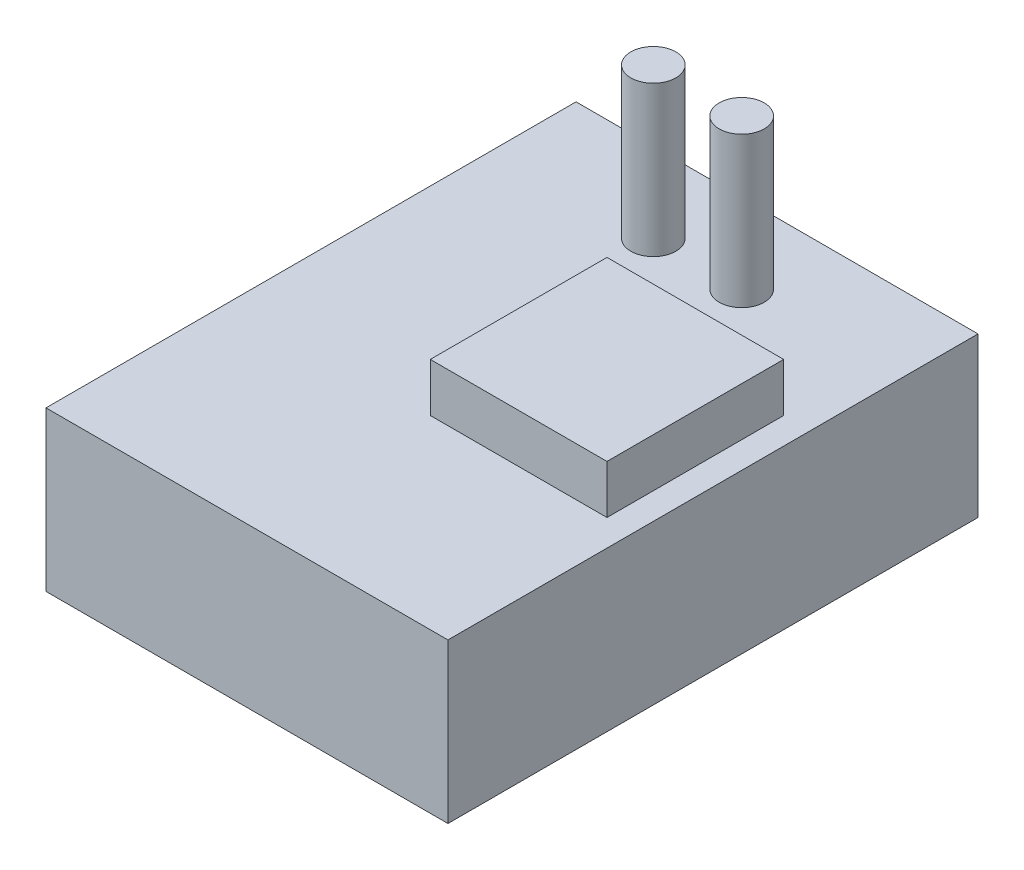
ISO-10303-21;
HEADER;
FILE_DESCRIPTION(('STEP AP214'),'2;1');
FILE_NAME('part.step','',(''),(''),'','','');
FILE_SCHEMA(('AUTOMOTIVE_DESIGN { 1 0 10303 214 1 1 1 1 }'));
ENDSEC;
DATA;
#1=APPLICATION_CONTEXT('core data for automotive mechanical design processes');
#2=APPLICATION_PROTOCOL_DEFINITION('international standard','automotive_design',2000,#1);
#3=PRODUCT_CONTEXT('',#1,'mechanical');
#4=PRODUCT('Part','Part','',(#3));
#5=PRODUCT_RELATED_PRODUCT_CATEGORY('part','',(#4));
#6=PRODUCT_DEFINITION_FORMATION('','',#4);
#7=PRODUCT_DEFINITION_CONTEXT('part definition',#1,'design');
#8=PRODUCT_DEFINITION('design','',#6,#7);
#9=PRODUCT_DEFINITION_SHAPE('','',#8);
#10=(LENGTH_UNIT() NAMED_UNIT(*) SI_UNIT(.MILLI.,.METRE.));
#11=(NAMED_UNIT(*) PLANE_ANGLE_UNIT() SI_UNIT($,.RADIAN.));
#12=(NAMED_UNIT(*) SI_UNIT($,.STERADIAN.) SOLID_ANGLE_UNIT());
#13=UNCERTAINTY_MEASURE_WITH_UNIT(LENGTH_MEASURE(1.E-05),#10,'distance_accuracy_value','');
#14=(GEOMETRIC_REPRESENTATION_CONTEXT(3) GLOBAL_UNCERTAINTY_ASSIGNED_CONTEXT((#13)) GLOBAL_UNIT_ASSIGNED_CONTEXT((#10,
#11,#12)) REPRESENTATION_CONTEXT('',''));
#15=CARTESIAN_POINT('',(0.,0.,0.));
#16=DIRECTION('',(0.,0.,1.));
#17=DIRECTION('',(1.,0.,0.));
#18=AXIS2_PLACEMENT_3D('',#15,#16,#17);
#19=CARTESIAN_POINT('',(0.,36.,0.));
#20=DIRECTION('',(0.,1.,0.));
#21=DIRECTION('',(0.,0.,1.));
#22=AXIS2_PLACEMENT_3D('',#19,#20,#21);
#23=PLANE('',#22);
#24=CARTESIAN_POINT('',(-10.,36.,-42.));
#25=DIRECTION('',(0.,1.,0.));
#26=DIRECTION('',(0.,0.,1.));
#27=AXIS2_PLACEMENT_3D('',#24,#25,#26);
#28=CIRCLE('',#27,5.1);
#29=CARTESIAN_POINT('',(-10.,36.,-36.9));
#30=VERTEX_POINT('',#29);
#31=EDGE_CURVE('E218',#30,#30,#28,.T.);
#32=ORIENTED_EDGE('',*,*,#31,.F.);
#33=EDGE_LOOP('',(#32));
#34=FACE_BOUND('',#33,.T.);
#35=DIRECTION('',(0.,0.,-1.));
#36=VECTOR('',#35,1.);
#37=CARTESIAN_POINT('',(45.5,36.,-60.));
#38=LINE('',#37,#36);
#39=CARTESIAN_POINT('',(45.5,36.,60.));
#40=VERTEX_POINT('',#39);
#41=CARTESIAN_POINT('',(45.5,36.,-60.));
#42=VERTEX_POINT('',#41);
#43=EDGE_CURVE('E140',#40,#42,#38,.T.);
#44=ORIENTED_EDGE('',*,*,#43,.T.);
#45=DIRECTION('',(-1.,0.,0.));
#46=VECTOR('',#45,1.);
#47=CARTESIAN_POINT('',(-45.5,36.,-60.));
#48=LINE('',#47,#46);
#49=CARTESIAN_POINT('',(-45.5,36.,-60.));
#50=VERTEX_POINT('',#49);
#51=EDGE_CURVE('E85',#42,#50,#48,.T.);
#52=ORIENTED_EDGE('',*,*,#51,.T.);
#53=DIRECTION('',(0.,0.,1.));
#54=VECTOR('',#53,1.);
#55=CARTESIAN_POINT('',(-45.5,36.,-60.));
#56=LINE('',#55,#54);
#57=CARTESIAN_POINT('',(-45.5,36.,60.));
#58=VERTEX_POINT('',#57);
#59=EDGE_CURVE('E143',#50,#58,#56,.T.);
#60=ORIENTED_EDGE('',*,*,#59,.T.);
#61=DIRECTION('',(1.,0.,0.));
#62=VECTOR('',#61,1.);
#63=CARTESIAN_POINT('',(-45.5,36.,60.));
#64=LINE('',#63,#62);
#65=EDGE_CURVE('E57',#58,#40,#64,.T.);
#66=ORIENTED_EDGE('',*,*,#65,.T.);
#67=EDGE_LOOP('',(#44,#52,#60,#66));
#68=FACE_BOUND('',#67,.T.);
#69=DIRECTION('',(-1.,0.,0.));
#70=VECTOR('',#69,1.);
#71=CARTESIAN_POINT('',(-0.499999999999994,36.,-22.));
#72=LINE('',#71,#70);
#73=CARTESIAN_POINT('',(39.5,36.,-22.));
#74=VERTEX_POINT('',#73);
#75=CARTESIAN_POINT('',(-0.499999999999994,36.,-22.));
#76=VERTEX_POINT('',#75);
#77=EDGE_CURVE('E233',#74,#76,#72,.T.);
#78=ORIENTED_EDGE('',*,*,#77,.F.);
#79=DIRECTION('',(0.,0.,-1.));
#80=VECTOR('',#79,1.);
#81=CARTESIAN_POINT('',(39.5,36.,-22.));
#82=LINE('',#81,#80);
#83=CARTESIAN_POINT('',(39.5,36.,18.));
#84=VERTEX_POINT('',#83);
#85=EDGE_CURVE('E130',#84,#74,#82,.T.);
#86=ORIENTED_EDGE('',*,*,#85,.F.);
#87=DIRECTION('',(1.,0.,0.));
#88=VECTOR('',#87,1.);
#89=CARTESIAN_POINT('',(-0.5,36.,18.));
#90=LINE('',#89,#88);
#91=CARTESIAN_POINT('',(-0.5,36.,18.));
#92=VERTEX_POINT('',#91);
#93=EDGE_CURVE('E126',#92,#84,#90,.T.);
#94=ORIENTED_EDGE('',*,*,#93,.F.);
#95=DIRECTION('',(0.,0.,1.));
#96=VECTOR('',#95,1.);
#97=CARTESIAN_POINT('',(-0.499999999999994,36.,-22.));
#98=LINE('',#97,#96);
#99=EDGE_CURVE('E235',#76,#92,#98,.T.);
#100=ORIENTED_EDGE('',*,*,#99,.F.);
#101=EDGE_LOOP('',(#78,#86,#94,#100));
#102=FACE_BOUND('',#101,.T.);
#103=CARTESIAN_POINT('',(10.,36.,-42.));
#104=DIRECTION('',(0.,1.,0.));
#105=DIRECTION('',(0.,0.,1.));
#106=AXIS2_PLACEMENT_3D('',#103,#104,#105);
#107=CIRCLE('',#106,5.1);
#108=CARTESIAN_POINT('',(10.,36.,-36.9));
#109=VERTEX_POINT('',#108);
#110=EDGE_CURVE('E219',#109,#109,#107,.T.);
#111=ORIENTED_EDGE('',*,*,#110,.F.);
#112=EDGE_LOOP('',(#111));
#113=FACE_BOUND('',#112,.T.);
#114=ADVANCED_FACE('F33',(#34,#68,#102,#113),#23,.T.);
#115=CARTESIAN_POINT('',(45.5,36.,-60.));
#116=DIRECTION('',(-1.,0.,0.));
#117=DIRECTION('',(0.,0.,1.));
#118=AXIS2_PLACEMENT_3D('',#115,#116,#117);
#119=PLANE('',#118);
#120=DIRECTION('',(0.,0.,-1.));
#121=VECTOR('',#120,1.);
#122=CARTESIAN_POINT('',(45.5,0.,-60.));
#123=LINE('',#122,#121);
#124=CARTESIAN_POINT('',(45.5,0.,60.));
#125=VERTEX_POINT('',#124);
#126=CARTESIAN_POINT('',(45.5,0.,-60.));
#127=VERTEX_POINT('',#126);
#128=EDGE_CURVE('E132',#125,#127,#123,.T.);
#129=ORIENTED_EDGE('',*,*,#128,.T.);
#130=DIRECTION('',(0.,-1.,0.));
#131=VECTOR('',#130,1.);
#132=CARTESIAN_POINT('',(45.5,36.,-60.));
#133=LINE('',#132,#131);
#134=EDGE_CURVE('E11',#42,#127,#133,.T.);
#135=ORIENTED_EDGE('',*,*,#134,.F.);
#136=ORIENTED_EDGE('',*,*,#43,.F.);
#137=DIRECTION('',(0.,-1.,0.));
#138=VECTOR('',#137,1.);
#139=CARTESIAN_POINT('',(45.5,36.,60.));
#140=LINE('',#139,#138);
#141=EDGE_CURVE('E145',#40,#125,#140,.T.);
#142=ORIENTED_EDGE('',*,*,#141,.T.);
#143=EDGE_LOOP('',(#129,#135,#136,#142));
#144=FACE_BOUND('',#143,.T.);
#145=ADVANCED_FACE('F35',(#144),#119,.F.);
#146=CARTESIAN_POINT('',(-45.5,36.,-60.));
#147=DIRECTION('',(0.,0.,1.));
#148=DIRECTION('',(1.,0.,0.));
#149=AXIS2_PLACEMENT_3D('',#146,#147,#148);
#150=PLANE('',#149);
#151=DIRECTION('',(-1.,0.,0.));
#152=VECTOR('',#151,1.);
#153=CARTESIAN_POINT('',(-45.5,0.,-60.));
#154=LINE('',#153,#152);
#155=CARTESIAN_POINT('',(-45.5,0.,-60.));
#156=VERTEX_POINT('',#155);
#157=EDGE_CURVE('E135',#127,#156,#154,.T.);
#158=ORIENTED_EDGE('',*,*,#157,.T.);
#159=DIRECTION('',(0.,-1.,0.));
#160=VECTOR('',#159,1.);
#161=CARTESIAN_POINT('',(-45.5,36.,-60.));
#162=LINE('',#161,#160);
#163=EDGE_CURVE('E41',#50,#156,#162,.T.);
#164=ORIENTED_EDGE('',*,*,#163,.F.);
#165=ORIENTED_EDGE('',*,*,#51,.F.);
#166=ORIENTED_EDGE('',*,*,#134,.T.);
#167=EDGE_LOOP('',(#158,#164,#165,#166));
#168=FACE_BOUND('',#167,.T.);
#169=ADVANCED_FACE('F173',(#168),#150,.F.);
#170=CARTESIAN_POINT('',(-45.5,36.,-60.));
#171=DIRECTION('',(1.,0.,0.));
#172=DIRECTION('',(0.,0.,-1.));
#173=AXIS2_PLACEMENT_3D('',#170,#171,#172);
#174=PLANE('',#173);
#175=DIRECTION('',(0.,0.,1.));
#176=VECTOR('',#175,1.);
#177=CARTESIAN_POINT('',(-45.5,0.,-60.));
#178=LINE('',#177,#176);
#179=CARTESIAN_POINT('',(-45.5,0.,60.));
#180=VERTEX_POINT('',#179);
#181=EDGE_CURVE('E148',#156,#180,#178,.T.);
#182=ORIENTED_EDGE('',*,*,#181,.T.);
#183=DIRECTION('',(0.,-1.,0.));
#184=VECTOR('',#183,1.);
#185=CARTESIAN_POINT('',(-45.5,36.,60.));
#186=LINE('',#185,#184);
#187=EDGE_CURVE('E152',#58,#180,#186,.T.);
#188=ORIENTED_EDGE('',*,*,#187,.F.);
#189=ORIENTED_EDGE('',*,*,#59,.F.);
#190=ORIENTED_EDGE('',*,*,#163,.T.);
#191=EDGE_LOOP('',(#182,#188,#189,#190));
#192=FACE_BOUND('',#191,.T.);
#193=ADVANCED_FACE('F157',(#192),#174,.F.);
#194=CARTESIAN_POINT('',(-45.5,36.,60.));
#195=DIRECTION('',(0.,0.,-1.));
#196=DIRECTION('',(-1.,0.,0.));
#197=AXIS2_PLACEMENT_3D('',#194,#195,#196);
#198=PLANE('',#197);
#199=DIRECTION('',(1.,0.,0.));
#200=VECTOR('',#199,1.);
#201=CARTESIAN_POINT('',(-45.5,0.,60.));
#202=LINE('',#201,#200);
#203=EDGE_CURVE('E78',#180,#125,#202,.T.);
#204=ORIENTED_EDGE('',*,*,#203,.T.);
#205=ORIENTED_EDGE('',*,*,#141,.F.);
#206=ORIENTED_EDGE('',*,*,#65,.F.);
#207=ORIENTED_EDGE('',*,*,#187,.T.);
#208=EDGE_LOOP('',(#204,#205,#206,#207));
#209=FACE_BOUND('',#208,.T.);
#210=ADVANCED_FACE('F165',(#209),#198,.F.);
#211=CARTESIAN_POINT('',(0.,0.,0.));
#212=DIRECTION('',(0.,1.,0.));
#213=DIRECTION('',(0.,0.,1.));
#214=AXIS2_PLACEMENT_3D('',#211,#212,#213);
#215=PLANE('',#214);
#216=ORIENTED_EDGE('',*,*,#128,.F.);
#217=ORIENTED_EDGE('',*,*,#203,.F.);
#218=ORIENTED_EDGE('',*,*,#181,.F.);
#219=ORIENTED_EDGE('',*,*,#157,.F.);
#220=EDGE_LOOP('',(#216,#217,#218,#219));
#221=FACE_BOUND('',#220,.T.);
#222=ADVANCED_FACE('F161',(#221),#215,.F.);
#223=CARTESIAN_POINT('',(39.5,47.,-22.));
#224=DIRECTION('',(-1.,0.,0.));
#225=DIRECTION('',(0.,0.,1.));
#226=AXIS2_PLACEMENT_3D('',#223,#224,#225);
#227=PLANE('',#226);
#228=ORIENTED_EDGE('',*,*,#85,.T.);
#229=DIRECTION('',(0.,-1.,0.));
#230=VECTOR('',#229,1.);
#231=CARTESIAN_POINT('',(39.5,47.,-22.));
#232=LINE('',#231,#230);
#233=CARTESIAN_POINT('',(39.5,47.,-22.));
#234=VERTEX_POINT('',#233);
#235=EDGE_CURVE('E111',#234,#74,#232,.T.);
#236=ORIENTED_EDGE('',*,*,#235,.F.);
#237=DIRECTION('',(0.,0.,-1.));
#238=VECTOR('',#237,1.);
#239=CARTESIAN_POINT('',(39.5,47.,-22.));
#240=LINE('',#239,#238);
#241=CARTESIAN_POINT('',(39.5,47.,18.));
#242=VERTEX_POINT('',#241);
#243=EDGE_CURVE('E118',#242,#234,#240,.T.);
#244=ORIENTED_EDGE('',*,*,#243,.F.);
#245=DIRECTION('',(0.,-1.,0.));
#246=VECTOR('',#245,1.);
#247=CARTESIAN_POINT('',(39.5,47.,18.));
#248=LINE('',#247,#246);
#249=EDGE_CURVE('E231',#242,#84,#248,.T.);
#250=ORIENTED_EDGE('',*,*,#249,.T.);
#251=EDGE_LOOP('',(#228,#236,#244,#250));
#252=FACE_BOUND('',#251,.T.);
#253=ADVANCED_FACE('F128',(#252),#227,.F.);
#254=CARTESIAN_POINT('',(-0.499999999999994,47.,-22.));
#255=DIRECTION('',(0.,0.,1.));
#256=DIRECTION('',(1.,0.,0.));
#257=AXIS2_PLACEMENT_3D('',#254,#255,#256);
#258=PLANE('',#257);
#259=ORIENTED_EDGE('',*,*,#77,.T.);
#260=DIRECTION('',(0.,-1.,0.));
#261=VECTOR('',#260,1.);
#262=CARTESIAN_POINT('',(-0.499999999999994,47.,-22.));
#263=LINE('',#262,#261);
#264=CARTESIAN_POINT('',(-0.499999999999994,47.,-22.));
#265=VERTEX_POINT('',#264);
#266=EDGE_CURVE('E114',#265,#76,#263,.T.);
#267=ORIENTED_EDGE('',*,*,#266,.F.);
#268=DIRECTION('',(-1.,0.,0.));
#269=VECTOR('',#268,1.);
#270=CARTESIAN_POINT('',(-0.499999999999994,47.,-22.));
#271=LINE('',#270,#269);
#272=EDGE_CURVE('E107',#234,#265,#271,.T.);
#273=ORIENTED_EDGE('',*,*,#272,.F.);
#274=ORIENTED_EDGE('',*,*,#235,.T.);
#275=EDGE_LOOP('',(#259,#267,#273,#274));
#276=FACE_BOUND('',#275,.T.);
#277=ADVANCED_FACE('F109',(#276),#258,.F.);
#278=CARTESIAN_POINT('',(-0.499999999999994,47.,-22.));
#279=DIRECTION('',(1.,0.,0.));
#280=DIRECTION('',(0.,0.,-1.));
#281=AXIS2_PLACEMENT_3D('',#278,#279,#280);
#282=PLANE('',#281);
#283=ORIENTED_EDGE('',*,*,#99,.T.);
#284=DIRECTION('',(0.,-1.,0.));
#285=VECTOR('',#284,1.);
#286=CARTESIAN_POINT('',(-0.5,47.,18.));
#287=LINE('',#286,#285);
#288=CARTESIAN_POINT('',(-0.5,47.,18.));
#289=VERTEX_POINT('',#288);
#290=EDGE_CURVE('E48',#289,#92,#287,.T.);
#291=ORIENTED_EDGE('',*,*,#290,.F.);
#292=DIRECTION('',(0.,0.,1.));
#293=VECTOR('',#292,1.);
#294=CARTESIAN_POINT('',(-0.499999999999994,47.,-22.));
#295=LINE('',#294,#293);
#296=EDGE_CURVE('E117',#265,#289,#295,.T.);
#297=ORIENTED_EDGE('',*,*,#296,.F.);
#298=ORIENTED_EDGE('',*,*,#266,.T.);
#299=EDGE_LOOP('',(#283,#291,#297,#298));
#300=FACE_BOUND('',#299,.T.);
#301=ADVANCED_FACE('F189',(#300),#282,.F.);
#302=CARTESIAN_POINT('',(-0.5,47.,18.));
#303=DIRECTION('',(0.,0.,-1.));
#304=DIRECTION('',(-1.,0.,0.));
#305=AXIS2_PLACEMENT_3D('',#302,#303,#304);
#306=PLANE('',#305);
#307=ORIENTED_EDGE('',*,*,#93,.T.);
#308=ORIENTED_EDGE('',*,*,#249,.F.);
#309=DIRECTION('',(1.,0.,0.));
#310=VECTOR('',#309,1.);
#311=CARTESIAN_POINT('',(-0.5,47.,18.));
#312=LINE('',#311,#310);
#313=EDGE_CURVE('E122',#289,#242,#312,.T.);
#314=ORIENTED_EDGE('',*,*,#313,.F.);
#315=ORIENTED_EDGE('',*,*,#290,.T.);
#316=EDGE_LOOP('',(#307,#308,#314,#315));
#317=FACE_BOUND('',#316,.T.);
#318=ADVANCED_FACE('F192',(#317),#306,.F.);
#319=CARTESIAN_POINT('',(0.,47.,0.));
#320=DIRECTION('',(0.,1.,0.));
#321=DIRECTION('',(0.,0.,1.));
#322=AXIS2_PLACEMENT_3D('',#319,#320,#321);
#323=PLANE('',#322);
#324=ORIENTED_EDGE('',*,*,#243,.T.);
#325=ORIENTED_EDGE('',*,*,#272,.T.);
#326=ORIENTED_EDGE('',*,*,#296,.T.);
#327=ORIENTED_EDGE('',*,*,#313,.T.);
#328=EDGE_LOOP('',(#324,#325,#326,#327));
#329=FACE_BOUND('',#328,.T.);
#330=ADVANCED_FACE('F121',(#329),#323,.T.);
#331=CARTESIAN_POINT('',(-10.,70.,-42.));
#332=DIRECTION('',(0.,-1.,0.));
#333=DIRECTION('',(0.,0.,-1.));
#334=AXIS2_PLACEMENT_3D('',#331,#332,#333);
#335=CYLINDRICAL_SURFACE('',#334,5.1);
#336=CARTESIAN_POINT('',(-10.,70.,-42.));
#337=DIRECTION('',(0.,1.,0.));
#338=DIRECTION('',(0.,0.,1.));
#339=AXIS2_PLACEMENT_3D('',#336,#337,#338);
#340=CIRCLE('',#339,5.1);
#341=CARTESIAN_POINT('',(-10.,70.,-36.9));
#342=VERTEX_POINT('',#341);
#343=EDGE_CURVE('E222',#342,#342,#340,.T.);
#344=ORIENTED_EDGE('',*,*,#343,.F.);
#345=EDGE_LOOP('',(#344));
#346=FACE_BOUND('',#345,.T.);
#347=ORIENTED_EDGE('',*,*,#31,.T.);
#348=EDGE_LOOP('',(#347));
#349=FACE_BOUND('',#348,.T.);
#350=ADVANCED_FACE('F198',(#346,#349),#335,.T.);
#351=CARTESIAN_POINT('',(-10.,70.,-42.));
#352=DIRECTION('',(0.,1.,0.));
#353=DIRECTION('',(0.,0.,1.));
#354=AXIS2_PLACEMENT_3D('',#351,#352,#353);
#355=PLANE('',#354);
#356=ORIENTED_EDGE('',*,*,#343,.T.);
#357=EDGE_LOOP('',(#356));
#358=FACE_BOUND('',#357,.T.);
#359=ADVANCED_FACE('F201',(#358),#355,.T.);
#360=CARTESIAN_POINT('',(10.,70.,-42.));
#361=DIRECTION('',(0.,-1.,0.));
#362=DIRECTION('',(0.,0.,-1.));
#363=AXIS2_PLACEMENT_3D('',#360,#361,#362);
#364=CYLINDRICAL_SURFACE('',#363,5.1);
#365=CARTESIAN_POINT('',(10.,70.,-42.));
#366=DIRECTION('',(0.,1.,0.));
#367=DIRECTION('',(0.,0.,1.));
#368=AXIS2_PLACEMENT_3D('',#365,#366,#367);
#369=CIRCLE('',#368,5.1);
#370=CARTESIAN_POINT('',(10.,70.,-36.9));
#371=VERTEX_POINT('',#370);
#372=EDGE_CURVE('E217',#371,#371,#369,.T.);
#373=ORIENTED_EDGE('',*,*,#372,.F.);
#374=EDGE_LOOP('',(#373));
#375=FACE_BOUND('',#374,.T.);
#376=ORIENTED_EDGE('',*,*,#110,.T.);
#377=EDGE_LOOP('',(#376));
#378=FACE_BOUND('',#377,.T.);
#379=ADVANCED_FACE('F205',(#375,#378),#364,.T.);
#380=CARTESIAN_POINT('',(10.,70.,-42.));
#381=DIRECTION('',(0.,1.,0.));
#382=DIRECTION('',(0.,0.,1.));
#383=AXIS2_PLACEMENT_3D('',#380,#381,#382);
#384=PLANE('',#383);
#385=ORIENTED_EDGE('',*,*,#372,.T.);
#386=EDGE_LOOP('',(#385));
#387=FACE_BOUND('',#386,.T.);
#388=ADVANCED_FACE('F209',(#387),#384,.T.);
#389=CLOSED_SHELL('',(#114,#145,#169,#193,#210,#222,#253,#277,#301,#318,#330,#350,#359,#379,#388));
#390=MANIFOLD_SOLID_BREP('B2',#389);
#391=ADVANCED_BREP_SHAPE_REPRESENTATION('',(#18,#390),#14);
#392=SHAPE_DEFINITION_REPRESENTATION(#9,#391);
ENDSEC;
END-ISO-10303-21;
